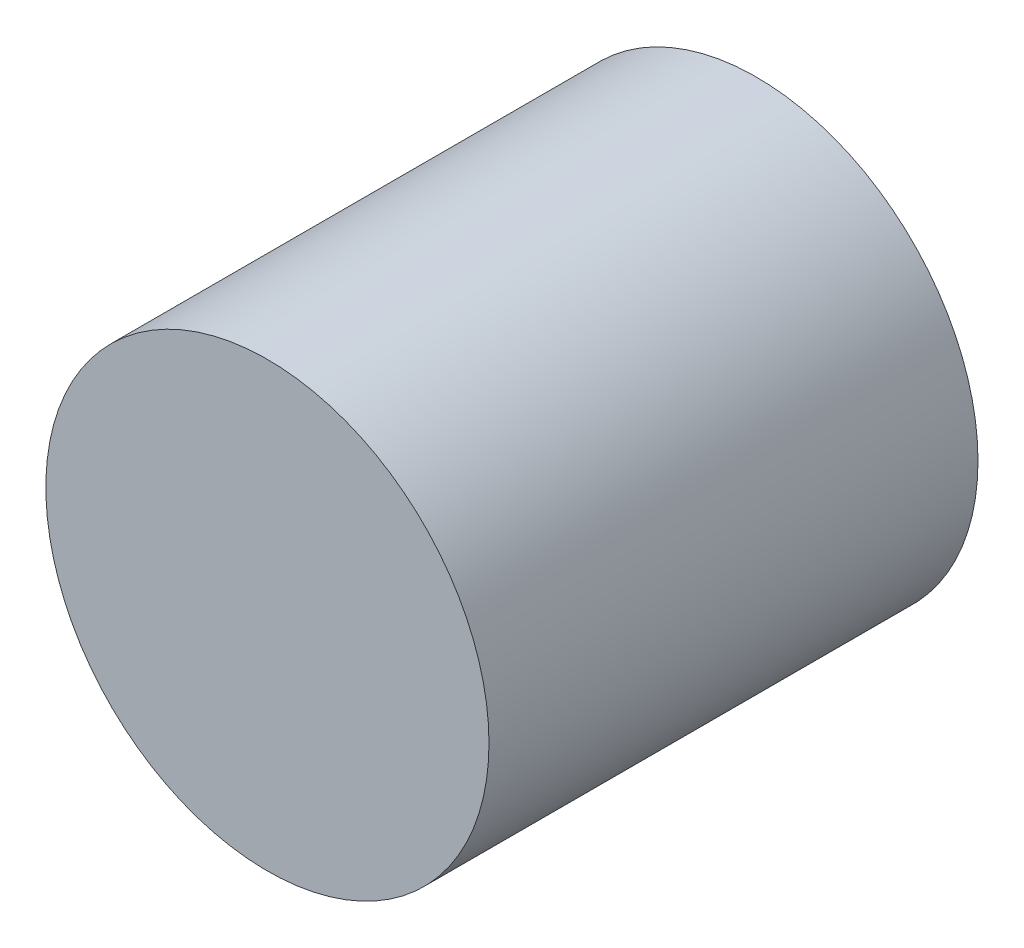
from build123d import *

# Parameters (mm, degrees)
ESQUISSE1_R        = 14.5
BOSS_EXTRU_1_DEPTH = 32


with BuildPart() as part:
    # Esquisse1 → Boss.-Extru.1 (new body)
    with BuildSketch(Plane.XY):
        Circle(ESQUISSE1_R)
    extrude(amount=BOSS_EXTRU_1_DEPTH)


solid = part.part
